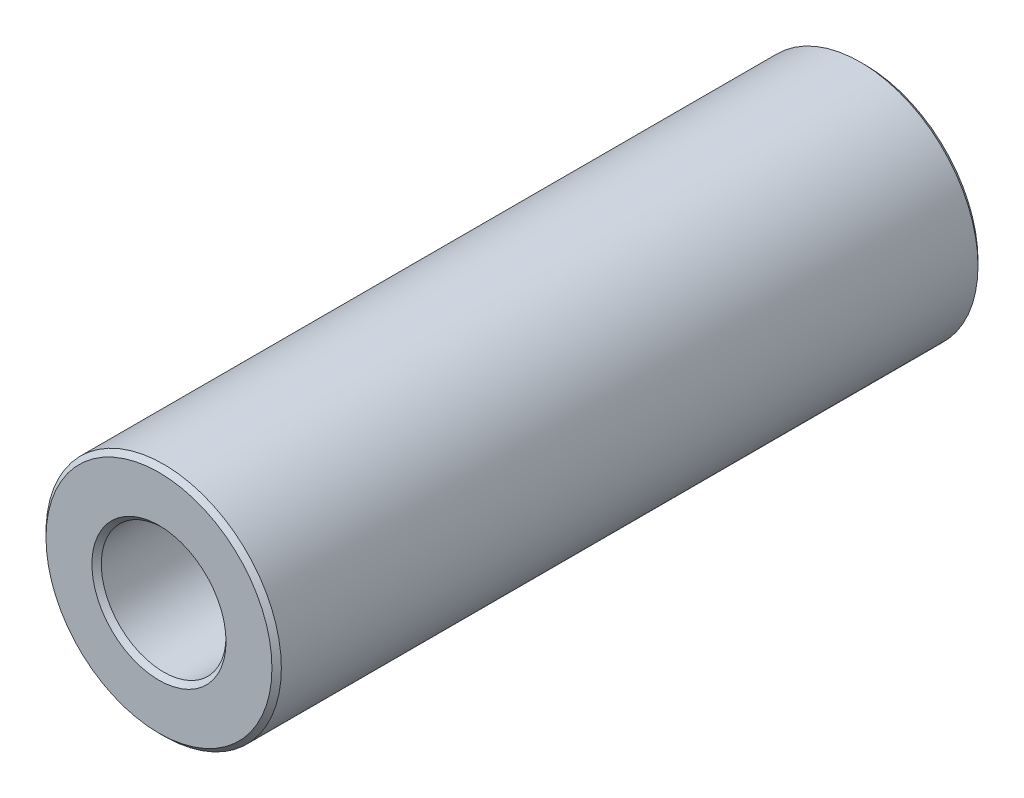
from build123d import *

# Parameters (mm, degrees)
SKETCH1_R           = 5
SKETCH1_R_2         = 2.65
BOSS_EXTRUDE2_DEPTH = 15
CHAMFER3_SIZE       = 0.2


with BuildPart() as part:
    # Sketch1 → Boss-Extrude2 (new, symmetric)
    with BuildSketch(Plane.XY):
        Circle(SKETCH1_R)
        Circle(SKETCH1_R_2, mode=Mode.SUBTRACT)
    extrude(amount=BOSS_EXTRUDE2_DEPTH, both=True)

    # Chamfer3
    chamfer3_edges = [part.edges().sort_by_distance(p)[0] for p in [
        (-5, 0, -15),
        (-5, 0, 15),
        (-2.65, 0, -15),
        (-2.65, 0, 15),
    ]]
    chamfer(chamfer3_edges, length=CHAMFER3_SIZE)


solid = part.part
